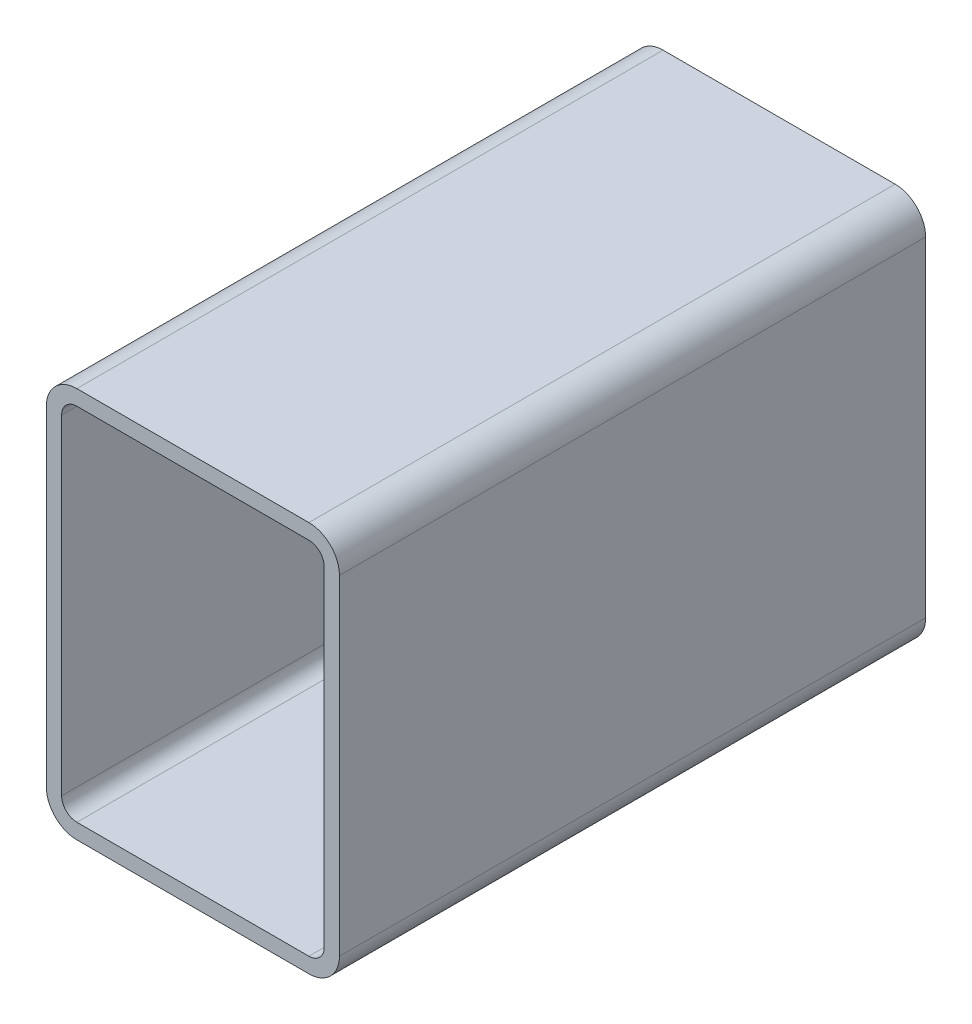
ISO-10303-21;
HEADER;
FILE_DESCRIPTION(('STEP AP214'),'2;1');
FILE_NAME('part.step','',(''),(''),'','','');
FILE_SCHEMA(('AUTOMOTIVE_DESIGN { 1 0 10303 214 1 1 1 1 }'));
ENDSEC;
DATA;
#1=APPLICATION_CONTEXT('core data for automotive mechanical design processes');
#2=APPLICATION_PROTOCOL_DEFINITION('international standard','automotive_design',2000,#1);
#3=PRODUCT_CONTEXT('',#1,'mechanical');
#4=PRODUCT('Part','Part','',(#3));
#5=PRODUCT_RELATED_PRODUCT_CATEGORY('part','',(#4));
#6=PRODUCT_DEFINITION_FORMATION('','',#4);
#7=PRODUCT_DEFINITION_CONTEXT('part definition',#1,'design');
#8=PRODUCT_DEFINITION('design','',#6,#7);
#9=PRODUCT_DEFINITION_SHAPE('','',#8);
#10=(LENGTH_UNIT() NAMED_UNIT(*) SI_UNIT(.MILLI.,.METRE.));
#11=(NAMED_UNIT(*) PLANE_ANGLE_UNIT() SI_UNIT($,.RADIAN.));
#12=(NAMED_UNIT(*) SI_UNIT($,.STERADIAN.) SOLID_ANGLE_UNIT());
#13=UNCERTAINTY_MEASURE_WITH_UNIT(LENGTH_MEASURE(1.E-05),#10,'distance_accuracy_value','');
#14=(GEOMETRIC_REPRESENTATION_CONTEXT(3) GLOBAL_UNCERTAINTY_ASSIGNED_CONTEXT((#13)) GLOBAL_UNIT_ASSIGNED_CONTEXT((#10,
#11,#12)) REPRESENTATION_CONTEXT('',''));
#15=CARTESIAN_POINT('',(0.,0.,0.));
#16=DIRECTION('',(0.,0.,1.));
#17=DIRECTION('',(1.,0.,0.));
#18=AXIS2_PLACEMENT_3D('',#15,#16,#17);
#19=CARTESIAN_POINT('',(15.9223013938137,189.291130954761,304.8));
#20=DIRECTION('',(0.,0.,1.));
#21=DIRECTION('',(1.,0.,0.));
#22=AXIS2_PLACEMENT_3D('',#19,#20,#21);
#23=PLANE('',#22);
#24=CARTESIAN_POINT('',(15.9223013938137,189.291130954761,304.8));
#25=DIRECTION('',(0.,0.,1.));
#26=DIRECTION('',(1.,0.,0.));
#27=AXIS2_PLACEMENT_3D('',#24,#25,#26);
#28=CIRCLE('',#27,15.875);
#29=CARTESIAN_POINT('',(15.9223013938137,205.166130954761,304.8));
#30=VERTEX_POINT('',#29);
#31=CARTESIAN_POINT('',(0.0473013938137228,189.291130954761,304.8));
#32=VERTEX_POINT('',#31);
#33=EDGE_CURVE('E211',#30,#32,#28,.T.);
#34=ORIENTED_EDGE('',*,*,#33,.T.);
#35=DIRECTION('',(0.,-1.,0.));
#36=VECTOR('',#35,1.);
#37=CARTESIAN_POINT('',(0.0473013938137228,17.8411309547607,304.8));
#38=LINE('',#37,#36);
#39=CARTESIAN_POINT('',(0.0473013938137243,17.8411309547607,304.8));
#40=VERTEX_POINT('',#39);
#41=EDGE_CURVE('E214',#32,#40,#38,.T.);
#42=ORIENTED_EDGE('',*,*,#41,.T.);
#43=CARTESIAN_POINT('',(15.9223013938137,17.8411309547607,304.8));
#44=DIRECTION('',(0.,0.,1.));
#45=DIRECTION('',(1.,0.,0.));
#46=AXIS2_PLACEMENT_3D('',#43,#44,#45);
#47=CIRCLE('',#46,15.875);
#48=CARTESIAN_POINT('',(15.9223013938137,1.96613095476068,304.8));
#49=VERTEX_POINT('',#48);
#50=EDGE_CURVE('E217',#40,#49,#47,.T.);
#51=ORIENTED_EDGE('',*,*,#50,.T.);
#52=DIRECTION('',(1.,0.,0.));
#53=VECTOR('',#52,1.);
#54=CARTESIAN_POINT('',(136.572301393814,1.96613095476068,304.8));
#55=LINE('',#54,#53);
#56=CARTESIAN_POINT('',(136.572301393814,1.96613095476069,304.8));
#57=VERTEX_POINT('',#56);
#58=EDGE_CURVE('E219',#49,#57,#55,.T.);
#59=ORIENTED_EDGE('',*,*,#58,.T.);
#60=CARTESIAN_POINT('',(136.572301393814,17.8411309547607,304.8));
#61=DIRECTION('',(0.,0.,1.));
#62=DIRECTION('',(1.,0.,0.));
#63=AXIS2_PLACEMENT_3D('',#60,#61,#62);
#64=CIRCLE('',#63,15.875);
#65=CARTESIAN_POINT('',(152.447301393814,17.8411309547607,304.8));
#66=VERTEX_POINT('',#65);
#67=EDGE_CURVE('E221',#57,#66,#64,.T.);
#68=ORIENTED_EDGE('',*,*,#67,.T.);
#69=DIRECTION('',(0.,1.,0.));
#70=VECTOR('',#69,1.);
#71=CARTESIAN_POINT('',(152.447301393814,189.291130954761,304.8));
#72=LINE('',#71,#70);
#73=CARTESIAN_POINT('',(152.447301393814,189.291130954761,304.8));
#74=VERTEX_POINT('',#73);
#75=EDGE_CURVE('E223',#66,#74,#72,.T.);
#76=ORIENTED_EDGE('',*,*,#75,.T.);
#77=CARTESIAN_POINT('',(136.572301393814,189.291130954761,304.8));
#78=DIRECTION('',(0.,0.,1.));
#79=DIRECTION('',(1.,0.,0.));
#80=AXIS2_PLACEMENT_3D('',#77,#78,#79);
#81=CIRCLE('',#80,15.875);
#82=CARTESIAN_POINT('',(136.572301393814,205.166130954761,304.8));
#83=VERTEX_POINT('',#82);
#84=EDGE_CURVE('E225',#74,#83,#81,.T.);
#85=ORIENTED_EDGE('',*,*,#84,.T.);
#86=DIRECTION('',(-1.,0.,0.));
#87=VECTOR('',#86,1.);
#88=CARTESIAN_POINT('',(15.9223013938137,205.166130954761,304.8));
#89=LINE('',#88,#87);
#90=EDGE_CURVE('E227',#83,#30,#89,.T.);
#91=ORIENTED_EDGE('',*,*,#90,.T.);
#92=EDGE_LOOP('',(#34,#42,#51,#59,#68,#76,#85,#91));
#93=FACE_BOUND('',#92,.T.);
#94=DIRECTION('',(0.,-1.,0.));
#95=VECTOR('',#94,1.);
#96=CARTESIAN_POINT('',(7.98480139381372,17.8411309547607,304.8));
#97=LINE('',#96,#95);
#98=CARTESIAN_POINT('',(7.98480139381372,189.291130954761,304.8));
#99=VERTEX_POINT('',#98);
#100=CARTESIAN_POINT('',(7.98480139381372,17.8411309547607,304.8));
#101=VERTEX_POINT('',#100);
#102=EDGE_CURVE('E154',#99,#101,#97,.T.);
#103=ORIENTED_EDGE('',*,*,#102,.F.);
#104=CARTESIAN_POINT('',(15.9223013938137,189.291130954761,304.8));
#105=DIRECTION('',(0.,0.,1.));
#106=DIRECTION('',(1.,0.,0.));
#107=AXIS2_PLACEMENT_3D('',#104,#105,#106);
#108=CIRCLE('',#107,7.9375);
#109=CARTESIAN_POINT('',(15.9223013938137,197.228630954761,304.8));
#110=VERTEX_POINT('',#109);
#111=EDGE_CURVE('E146',#110,#99,#108,.T.);
#112=ORIENTED_EDGE('',*,*,#111,.F.);
#113=DIRECTION('',(-1.,0.,0.));
#114=VECTOR('',#113,1.);
#115=CARTESIAN_POINT('',(15.9223013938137,197.228630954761,304.8));
#116=LINE('',#115,#114);
#117=CARTESIAN_POINT('',(136.572301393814,197.228630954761,304.8));
#118=VERTEX_POINT('',#117);
#119=EDGE_CURVE('E179',#118,#110,#116,.T.);
#120=ORIENTED_EDGE('',*,*,#119,.F.);
#121=CARTESIAN_POINT('',(136.572301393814,189.291130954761,304.8));
#122=DIRECTION('',(0.,0.,1.));
#123=DIRECTION('',(1.,0.,0.));
#124=AXIS2_PLACEMENT_3D('',#121,#122,#123);
#125=CIRCLE('',#124,7.9375);
#126=CARTESIAN_POINT('',(144.509801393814,189.291130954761,304.8));
#127=VERTEX_POINT('',#126);
#128=EDGE_CURVE('E177',#127,#118,#125,.T.);
#129=ORIENTED_EDGE('',*,*,#128,.F.);
#130=DIRECTION('',(0.,1.,0.));
#131=VECTOR('',#130,1.);
#132=CARTESIAN_POINT('',(144.509801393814,189.291130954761,304.8));
#133=LINE('',#132,#131);
#134=CARTESIAN_POINT('',(144.509801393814,17.8411309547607,304.8));
#135=VERTEX_POINT('',#134);
#136=EDGE_CURVE('E175',#135,#127,#133,.T.);
#137=ORIENTED_EDGE('',*,*,#136,.F.);
#138=CARTESIAN_POINT('',(136.572301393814,17.8411309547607,304.8));
#139=DIRECTION('',(0.,0.,1.));
#140=DIRECTION('',(1.,0.,0.));
#141=AXIS2_PLACEMENT_3D('',#138,#139,#140);
#142=CIRCLE('',#141,7.93750000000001);
#143=CARTESIAN_POINT('',(136.572301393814,9.90363095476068,304.8));
#144=VERTEX_POINT('',#143);
#145=EDGE_CURVE('E173',#144,#135,#142,.T.);
#146=ORIENTED_EDGE('',*,*,#145,.F.);
#147=DIRECTION('',(1.,0.,0.));
#148=VECTOR('',#147,1.);
#149=CARTESIAN_POINT('',(136.572301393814,9.90363095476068,304.8));
#150=LINE('',#149,#148);
#151=CARTESIAN_POINT('',(15.9223013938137,9.90363095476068,304.8));
#152=VERTEX_POINT('',#151);
#153=EDGE_CURVE('E169',#152,#144,#150,.T.);
#154=ORIENTED_EDGE('',*,*,#153,.F.);
#155=CARTESIAN_POINT('',(15.9223013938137,17.8411309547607,304.8));
#156=DIRECTION('',(0.,0.,1.));
#157=DIRECTION('',(1.,0.,0.));
#158=AXIS2_PLACEMENT_3D('',#155,#156,#157);
#159=CIRCLE('',#158,7.9375);
#160=EDGE_CURVE('E167',#101,#152,#159,.T.);
#161=ORIENTED_EDGE('',*,*,#160,.F.);
#162=EDGE_LOOP('',(#103,#112,#120,#129,#137,#146,#154,#161));
#163=FACE_BOUND('',#162,.T.);
#164=ADVANCED_FACE('F33',(#93,#163),#23,.T.);
#165=CARTESIAN_POINT('',(15.9223013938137,189.291130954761,0.));
#166=DIRECTION('',(0.,0.,1.));
#167=DIRECTION('',(1.,0.,0.));
#168=AXIS2_PLACEMENT_3D('',#165,#166,#167);
#169=PLANE('',#168);
#170=CARTESIAN_POINT('',(15.9223013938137,189.291130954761,0.));
#171=DIRECTION('',(0.,0.,1.));
#172=DIRECTION('',(1.,0.,0.));
#173=AXIS2_PLACEMENT_3D('',#170,#171,#172);
#174=CIRCLE('',#173,15.875);
#175=CARTESIAN_POINT('',(15.9223013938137,205.166130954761,0.));
#176=VERTEX_POINT('',#175);
#177=CARTESIAN_POINT('',(0.0473013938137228,189.291130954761,0.));
#178=VERTEX_POINT('',#177);
#179=EDGE_CURVE('E162',#176,#178,#174,.T.);
#180=ORIENTED_EDGE('',*,*,#179,.F.);
#181=DIRECTION('',(-1.,0.,0.));
#182=VECTOR('',#181,1.);
#183=CARTESIAN_POINT('',(15.9223013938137,205.166130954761,0.));
#184=LINE('',#183,#182);
#185=CARTESIAN_POINT('',(136.572301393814,205.166130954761,0.));
#186=VERTEX_POINT('',#185);
#187=EDGE_CURVE('E215',#186,#176,#184,.T.);
#188=ORIENTED_EDGE('',*,*,#187,.F.);
#189=CARTESIAN_POINT('',(136.572301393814,189.291130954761,0.));
#190=DIRECTION('',(0.,0.,1.));
#191=DIRECTION('',(1.,0.,0.));
#192=AXIS2_PLACEMENT_3D('',#189,#190,#191);
#193=CIRCLE('',#192,15.875);
#194=CARTESIAN_POINT('',(152.447301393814,189.291130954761,0.));
#195=VERTEX_POINT('',#194);
#196=EDGE_CURVE('E242',#195,#186,#193,.T.);
#197=ORIENTED_EDGE('',*,*,#196,.F.);
#198=DIRECTION('',(0.,1.,0.));
#199=VECTOR('',#198,1.);
#200=CARTESIAN_POINT('',(152.447301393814,189.291130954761,0.));
#201=LINE('',#200,#199);
#202=CARTESIAN_POINT('',(152.447301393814,17.8411309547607,0.));
#203=VERTEX_POINT('',#202);
#204=EDGE_CURVE('E240',#203,#195,#201,.T.);
#205=ORIENTED_EDGE('',*,*,#204,.F.);
#206=CARTESIAN_POINT('',(136.572301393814,17.8411309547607,0.));
#207=DIRECTION('',(0.,0.,1.));
#208=DIRECTION('',(1.,0.,0.));
#209=AXIS2_PLACEMENT_3D('',#206,#207,#208);
#210=CIRCLE('',#209,15.875);
#211=CARTESIAN_POINT('',(136.572301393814,1.96613095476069,0.));
#212=VERTEX_POINT('',#211);
#213=EDGE_CURVE('E238',#212,#203,#210,.T.);
#214=ORIENTED_EDGE('',*,*,#213,.F.);
#215=DIRECTION('',(1.,0.,0.));
#216=VECTOR('',#215,1.);
#217=CARTESIAN_POINT('',(136.572301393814,1.96613095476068,0.));
#218=LINE('',#217,#216);
#219=CARTESIAN_POINT('',(15.9223013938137,1.96613095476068,0.));
#220=VERTEX_POINT('',#219);
#221=EDGE_CURVE('E236',#220,#212,#218,.T.);
#222=ORIENTED_EDGE('',*,*,#221,.F.);
#223=CARTESIAN_POINT('',(15.9223013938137,17.8411309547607,0.));
#224=DIRECTION('',(0.,0.,1.));
#225=DIRECTION('',(1.,0.,0.));
#226=AXIS2_PLACEMENT_3D('',#223,#224,#225);
#227=CIRCLE('',#226,15.875);
#228=CARTESIAN_POINT('',(0.0473013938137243,17.8411309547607,0.));
#229=VERTEX_POINT('',#228);
#230=EDGE_CURVE('E234',#229,#220,#227,.T.);
#231=ORIENTED_EDGE('',*,*,#230,.F.);
#232=DIRECTION('',(0.,-1.,0.));
#233=VECTOR('',#232,1.);
#234=CARTESIAN_POINT('',(0.0473013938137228,17.8411309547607,0.));
#235=LINE('',#234,#233);
#236=EDGE_CURVE('E232',#178,#229,#235,.T.);
#237=ORIENTED_EDGE('',*,*,#236,.F.);
#238=EDGE_LOOP('',(#180,#188,#197,#205,#214,#222,#231,#237));
#239=FACE_BOUND('',#238,.T.);
#240=CARTESIAN_POINT('',(15.9223013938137,189.291130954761,0.));
#241=DIRECTION('',(0.,0.,1.));
#242=DIRECTION('',(1.,0.,0.));
#243=AXIS2_PLACEMENT_3D('',#240,#241,#242);
#244=CIRCLE('',#243,7.9375);
#245=CARTESIAN_POINT('',(15.9223013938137,197.228630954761,0.));
#246=VERTEX_POINT('',#245);
#247=CARTESIAN_POINT('',(7.98480139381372,189.291130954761,0.));
#248=VERTEX_POINT('',#247);
#249=EDGE_CURVE('E56',#246,#248,#244,.T.);
#250=ORIENTED_EDGE('',*,*,#249,.T.);
#251=DIRECTION('',(0.,-1.,0.));
#252=VECTOR('',#251,1.);
#253=CARTESIAN_POINT('',(7.98480139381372,17.8411309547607,0.));
#254=LINE('',#253,#252);
#255=CARTESIAN_POINT('',(7.98480139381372,17.8411309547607,0.));
#256=VERTEX_POINT('',#255);
#257=EDGE_CURVE('E161',#248,#256,#254,.T.);
#258=ORIENTED_EDGE('',*,*,#257,.T.);
#259=CARTESIAN_POINT('',(15.9223013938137,17.8411309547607,0.));
#260=DIRECTION('',(0.,0.,1.));
#261=DIRECTION('',(1.,0.,0.));
#262=AXIS2_PLACEMENT_3D('',#259,#260,#261);
#263=CIRCLE('',#262,7.9375);
#264=CARTESIAN_POINT('',(15.9223013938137,9.90363095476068,0.));
#265=VERTEX_POINT('',#264);
#266=EDGE_CURVE('E183',#256,#265,#263,.T.);
#267=ORIENTED_EDGE('',*,*,#266,.T.);
#268=DIRECTION('',(1.,0.,0.));
#269=VECTOR('',#268,1.);
#270=CARTESIAN_POINT('',(136.572301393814,9.90363095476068,0.));
#271=LINE('',#270,#269);
#272=CARTESIAN_POINT('',(136.572301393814,9.90363095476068,0.));
#273=VERTEX_POINT('',#272);
#274=EDGE_CURVE('E186',#265,#273,#271,.T.);
#275=ORIENTED_EDGE('',*,*,#274,.T.);
#276=CARTESIAN_POINT('',(136.572301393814,17.8411309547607,0.));
#277=DIRECTION('',(0.,0.,1.));
#278=DIRECTION('',(1.,0.,0.));
#279=AXIS2_PLACEMENT_3D('',#276,#277,#278);
#280=CIRCLE('',#279,7.93750000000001);
#281=CARTESIAN_POINT('',(144.509801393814,17.8411309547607,0.));
#282=VERTEX_POINT('',#281);
#283=EDGE_CURVE('E189',#273,#282,#280,.T.);
#284=ORIENTED_EDGE('',*,*,#283,.T.);
#285=DIRECTION('',(0.,1.,0.));
#286=VECTOR('',#285,1.);
#287=CARTESIAN_POINT('',(144.509801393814,189.291130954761,0.));
#288=LINE('',#287,#286);
#289=CARTESIAN_POINT('',(144.509801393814,189.291130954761,0.));
#290=VERTEX_POINT('',#289);
#291=EDGE_CURVE('E192',#282,#290,#288,.T.);
#292=ORIENTED_EDGE('',*,*,#291,.T.);
#293=CARTESIAN_POINT('',(136.572301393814,189.291130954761,0.));
#294=DIRECTION('',(0.,0.,1.));
#295=DIRECTION('',(1.,0.,0.));
#296=AXIS2_PLACEMENT_3D('',#293,#294,#295);
#297=CIRCLE('',#296,7.9375);
#298=CARTESIAN_POINT('',(136.572301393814,197.228630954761,0.));
#299=VERTEX_POINT('',#298);
#300=EDGE_CURVE('E195',#290,#299,#297,.T.);
#301=ORIENTED_EDGE('',*,*,#300,.T.);
#302=DIRECTION('',(-1.,0.,0.));
#303=VECTOR('',#302,1.);
#304=CARTESIAN_POINT('',(15.9223013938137,197.228630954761,0.));
#305=LINE('',#304,#303);
#306=EDGE_CURVE('E155',#299,#246,#305,.T.);
#307=ORIENTED_EDGE('',*,*,#306,.T.);
#308=EDGE_LOOP('',(#250,#258,#267,#275,#284,#292,#301,#307));
#309=FACE_BOUND('',#308,.T.);
#310=ADVANCED_FACE('F272',(#239,#309),#169,.F.);
#311=CARTESIAN_POINT('',(15.9223013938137,189.291130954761,304.8));
#312=DIRECTION('',(0.,0.,-1.));
#313=DIRECTION('',(-1.,0.,0.));
#314=AXIS2_PLACEMENT_3D('',#311,#312,#313);
#315=CYLINDRICAL_SURFACE('',#314,15.875);
#316=ORIENTED_EDGE('',*,*,#179,.T.);
#317=DIRECTION('',(0.,0.,-1.));
#318=VECTOR('',#317,1.);
#319=CARTESIAN_POINT('',(0.0473013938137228,189.291130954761,304.8));
#320=LINE('',#319,#318);
#321=EDGE_CURVE('E11',#32,#178,#320,.T.);
#322=ORIENTED_EDGE('',*,*,#321,.F.);
#323=ORIENTED_EDGE('',*,*,#33,.F.);
#324=DIRECTION('',(0.,0.,-1.));
#325=VECTOR('',#324,1.);
#326=CARTESIAN_POINT('',(15.9223013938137,205.166130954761,304.8));
#327=LINE('',#326,#325);
#328=EDGE_CURVE('E229',#30,#176,#327,.T.);
#329=ORIENTED_EDGE('',*,*,#328,.T.);
#330=EDGE_LOOP('',(#316,#322,#323,#329));
#331=FACE_BOUND('',#330,.T.);
#332=ADVANCED_FACE('F35',(#331),#315,.T.);
#333=CARTESIAN_POINT('',(0.0473013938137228,17.8411309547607,304.8));
#334=DIRECTION('',(1.,0.,0.));
#335=DIRECTION('',(0.,0.,-1.));
#336=AXIS2_PLACEMENT_3D('',#333,#334,#335);
#337=PLANE('',#336);
#338=ORIENTED_EDGE('',*,*,#236,.T.);
#339=DIRECTION('',(0.,0.,-1.));
#340=VECTOR('',#339,1.);
#341=CARTESIAN_POINT('',(0.0473013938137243,17.8411309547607,304.8));
#342=LINE('',#341,#340);
#343=EDGE_CURVE('E41',#40,#229,#342,.T.);
#344=ORIENTED_EDGE('',*,*,#343,.F.);
#345=ORIENTED_EDGE('',*,*,#41,.F.);
#346=ORIENTED_EDGE('',*,*,#321,.T.);
#347=EDGE_LOOP('',(#338,#344,#345,#346));
#348=FACE_BOUND('',#347,.T.);
#349=ADVANCED_FACE('F289',(#348),#337,.F.);
#350=CARTESIAN_POINT('',(15.9223013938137,17.8411309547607,304.8));
#351=DIRECTION('',(0.,0.,-1.));
#352=DIRECTION('',(-1.,0.,0.));
#353=AXIS2_PLACEMENT_3D('',#350,#351,#352);
#354=CYLINDRICAL_SURFACE('',#353,15.875);
#355=ORIENTED_EDGE('',*,*,#230,.T.);
#356=DIRECTION('',(0.,0.,-1.));
#357=VECTOR('',#356,1.);
#358=CARTESIAN_POINT('',(15.9223013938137,1.96613095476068,304.8));
#359=LINE('',#358,#357);
#360=EDGE_CURVE('E259',#49,#220,#359,.T.);
#361=ORIENTED_EDGE('',*,*,#360,.F.);
#362=ORIENTED_EDGE('',*,*,#50,.F.);
#363=ORIENTED_EDGE('',*,*,#343,.T.);
#364=EDGE_LOOP('',(#355,#361,#362,#363));
#365=FACE_BOUND('',#364,.T.);
#366=ADVANCED_FACE('F266',(#365),#354,.T.);
#367=CARTESIAN_POINT('',(136.572301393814,1.96613095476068,304.8));
#368=DIRECTION('',(0.,1.,0.));
#369=DIRECTION('',(0.,0.,1.));
#370=AXIS2_PLACEMENT_3D('',#367,#368,#369);
#371=PLANE('',#370);
#372=ORIENTED_EDGE('',*,*,#221,.T.);
#373=DIRECTION('',(0.,0.,-1.));
#374=VECTOR('',#373,1.);
#375=CARTESIAN_POINT('',(136.572301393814,1.96613095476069,304.8));
#376=LINE('',#375,#374);
#377=EDGE_CURVE('E256',#57,#212,#376,.T.);
#378=ORIENTED_EDGE('',*,*,#377,.F.);
#379=ORIENTED_EDGE('',*,*,#58,.F.);
#380=ORIENTED_EDGE('',*,*,#360,.T.);
#381=EDGE_LOOP('',(#372,#378,#379,#380));
#382=FACE_BOUND('',#381,.T.);
#383=ADVANCED_FACE('F278',(#382),#371,.F.);
#384=CARTESIAN_POINT('',(136.572301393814,17.8411309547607,304.8));
#385=DIRECTION('',(0.,0.,-1.));
#386=DIRECTION('',(-1.,0.,0.));
#387=AXIS2_PLACEMENT_3D('',#384,#385,#386);
#388=CYLINDRICAL_SURFACE('',#387,15.875);
#389=ORIENTED_EDGE('',*,*,#213,.T.);
#390=DIRECTION('',(0.,0.,-1.));
#391=VECTOR('',#390,1.);
#392=CARTESIAN_POINT('',(152.447301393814,17.8411309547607,304.8));
#393=LINE('',#392,#391);
#394=EDGE_CURVE('E253',#66,#203,#393,.T.);
#395=ORIENTED_EDGE('',*,*,#394,.F.);
#396=ORIENTED_EDGE('',*,*,#67,.F.);
#397=ORIENTED_EDGE('',*,*,#377,.T.);
#398=EDGE_LOOP('',(#389,#395,#396,#397));
#399=FACE_BOUND('',#398,.T.);
#400=ADVANCED_FACE('F282',(#399),#388,.T.);
#401=CARTESIAN_POINT('',(152.447301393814,189.291130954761,304.8));
#402=DIRECTION('',(-1.,0.,0.));
#403=DIRECTION('',(0.,0.,1.));
#404=AXIS2_PLACEMENT_3D('',#401,#402,#403);
#405=PLANE('',#404);
#406=ORIENTED_EDGE('',*,*,#204,.T.);
#407=DIRECTION('',(0.,0.,-1.));
#408=VECTOR('',#407,1.);
#409=CARTESIAN_POINT('',(152.447301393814,189.291130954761,304.8));
#410=LINE('',#409,#408);
#411=EDGE_CURVE('E250',#74,#195,#410,.T.);
#412=ORIENTED_EDGE('',*,*,#411,.F.);
#413=ORIENTED_EDGE('',*,*,#75,.F.);
#414=ORIENTED_EDGE('',*,*,#394,.T.);
#415=EDGE_LOOP('',(#406,#412,#413,#414));
#416=FACE_BOUND('',#415,.T.);
#417=ADVANCED_FACE('F302',(#416),#405,.F.);
#418=CARTESIAN_POINT('',(136.572301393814,189.291130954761,304.8));
#419=DIRECTION('',(0.,0.,-1.));
#420=DIRECTION('',(-1.,0.,0.));
#421=AXIS2_PLACEMENT_3D('',#418,#419,#420);
#422=CYLINDRICAL_SURFACE('',#421,15.875);
#423=ORIENTED_EDGE('',*,*,#196,.T.);
#424=DIRECTION('',(0.,0.,-1.));
#425=VECTOR('',#424,1.);
#426=CARTESIAN_POINT('',(136.572301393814,205.166130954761,304.8));
#427=LINE('',#426,#425);
#428=EDGE_CURVE('E247',#83,#186,#427,.T.);
#429=ORIENTED_EDGE('',*,*,#428,.F.);
#430=ORIENTED_EDGE('',*,*,#84,.F.);
#431=ORIENTED_EDGE('',*,*,#411,.T.);
#432=EDGE_LOOP('',(#423,#429,#430,#431));
#433=FACE_BOUND('',#432,.T.);
#434=ADVANCED_FACE('F300',(#433),#422,.T.);
#435=CARTESIAN_POINT('',(15.9223013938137,205.166130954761,304.8));
#436=DIRECTION('',(0.,-1.,0.));
#437=DIRECTION('',(0.,0.,-1.));
#438=AXIS2_PLACEMENT_3D('',#435,#436,#437);
#439=PLANE('',#438);
#440=ORIENTED_EDGE('',*,*,#187,.T.);
#441=ORIENTED_EDGE('',*,*,#328,.F.);
#442=ORIENTED_EDGE('',*,*,#90,.F.);
#443=ORIENTED_EDGE('',*,*,#428,.T.);
#444=EDGE_LOOP('',(#440,#441,#442,#443));
#445=FACE_BOUND('',#444,.T.);
#446=ADVANCED_FACE('F295',(#445),#439,.F.);
#447=CARTESIAN_POINT('',(15.9223013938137,189.291130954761,304.8));
#448=DIRECTION('',(0.,0.,-1.));
#449=DIRECTION('',(-1.,0.,0.));
#450=AXIS2_PLACEMENT_3D('',#447,#448,#449);
#451=CYLINDRICAL_SURFACE('',#450,7.9375);
#452=ORIENTED_EDGE('',*,*,#249,.F.);
#453=DIRECTION('',(0.,0.,-1.));
#454=VECTOR('',#453,1.);
#455=CARTESIAN_POINT('',(15.9223013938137,197.228630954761,304.8));
#456=LINE('',#455,#454);
#457=EDGE_CURVE('E150',#110,#246,#456,.T.);
#458=ORIENTED_EDGE('',*,*,#457,.F.);
#459=ORIENTED_EDGE('',*,*,#111,.T.);
#460=DIRECTION('',(0.,0.,-1.));
#461=VECTOR('',#460,1.);
#462=CARTESIAN_POINT('',(7.98480139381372,189.291130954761,304.8));
#463=LINE('',#462,#461);
#464=EDGE_CURVE('E149',#99,#248,#463,.T.);
#465=ORIENTED_EDGE('',*,*,#464,.T.);
#466=EDGE_LOOP('',(#452,#458,#459,#465));
#467=FACE_BOUND('',#466,.T.);
#468=ADVANCED_FACE('F148',(#467),#451,.F.);
#469=CARTESIAN_POINT('',(7.98480139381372,17.8411309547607,304.8));
#470=DIRECTION('',(1.,0.,0.));
#471=DIRECTION('',(0.,0.,-1.));
#472=AXIS2_PLACEMENT_3D('',#469,#470,#471);
#473=PLANE('',#472);
#474=ORIENTED_EDGE('',*,*,#257,.F.);
#475=ORIENTED_EDGE('',*,*,#464,.F.);
#476=ORIENTED_EDGE('',*,*,#102,.T.);
#477=DIRECTION('',(0.,0.,-1.));
#478=VECTOR('',#477,1.);
#479=CARTESIAN_POINT('',(7.98480139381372,17.8411309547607,304.8));
#480=LINE('',#479,#478);
#481=EDGE_CURVE('E163',#101,#256,#480,.T.);
#482=ORIENTED_EDGE('',*,*,#481,.T.);
#483=EDGE_LOOP('',(#474,#475,#476,#482));
#484=FACE_BOUND('',#483,.T.);
#485=ADVANCED_FACE('F158',(#484),#473,.T.);
#486=CARTESIAN_POINT('',(15.9223013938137,17.8411309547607,304.8));
#487=DIRECTION('',(0.,0.,-1.));
#488=DIRECTION('',(-1.,0.,0.));
#489=AXIS2_PLACEMENT_3D('',#486,#487,#488);
#490=CYLINDRICAL_SURFACE('',#489,7.9375);
#491=ORIENTED_EDGE('',*,*,#266,.F.);
#492=ORIENTED_EDGE('',*,*,#481,.F.);
#493=ORIENTED_EDGE('',*,*,#160,.T.);
#494=DIRECTION('',(0.,0.,-1.));
#495=VECTOR('',#494,1.);
#496=CARTESIAN_POINT('',(15.9223013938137,9.90363095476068,304.8));
#497=LINE('',#496,#495);
#498=EDGE_CURVE('E208',#152,#265,#497,.T.);
#499=ORIENTED_EDGE('',*,*,#498,.T.);
#500=EDGE_LOOP('',(#491,#492,#493,#499));
#501=FACE_BOUND('',#500,.T.);
#502=ADVANCED_FACE('F327',(#501),#490,.F.);
#503=CARTESIAN_POINT('',(136.572301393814,9.90363095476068,304.8));
#504=DIRECTION('',(0.,1.,0.));
#505=DIRECTION('',(0.,0.,1.));
#506=AXIS2_PLACEMENT_3D('',#503,#504,#505);
#507=PLANE('',#506);
#508=ORIENTED_EDGE('',*,*,#274,.F.);
#509=ORIENTED_EDGE('',*,*,#498,.F.);
#510=ORIENTED_EDGE('',*,*,#153,.T.);
#511=DIRECTION('',(0.,0.,-1.));
#512=VECTOR('',#511,1.);
#513=CARTESIAN_POINT('',(136.572301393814,9.90363095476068,304.8));
#514=LINE('',#513,#512);
#515=EDGE_CURVE('E206',#144,#273,#514,.T.);
#516=ORIENTED_EDGE('',*,*,#515,.T.);
#517=EDGE_LOOP('',(#508,#509,#510,#516));
#518=FACE_BOUND('',#517,.T.);
#519=ADVANCED_FACE('F331',(#518),#507,.T.);
#520=CARTESIAN_POINT('',(136.572301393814,17.8411309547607,304.8));
#521=DIRECTION('',(0.,0.,-1.));
#522=DIRECTION('',(-1.,0.,0.));
#523=AXIS2_PLACEMENT_3D('',#520,#521,#522);
#524=CYLINDRICAL_SURFACE('',#523,7.93750000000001);
#525=ORIENTED_EDGE('',*,*,#283,.F.);
#526=ORIENTED_EDGE('',*,*,#515,.F.);
#527=ORIENTED_EDGE('',*,*,#145,.T.);
#528=DIRECTION('',(0.,0.,-1.));
#529=VECTOR('',#528,1.);
#530=CARTESIAN_POINT('',(144.509801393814,17.8411309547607,304.8));
#531=LINE('',#530,#529);
#532=EDGE_CURVE('E204',#135,#282,#531,.T.);
#533=ORIENTED_EDGE('',*,*,#532,.T.);
#534=EDGE_LOOP('',(#525,#526,#527,#533));
#535=FACE_BOUND('',#534,.T.);
#536=ADVANCED_FACE('F337',(#535),#524,.F.);
#537=CARTESIAN_POINT('',(144.509801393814,189.291130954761,304.8));
#538=DIRECTION('',(-1.,0.,0.));
#539=DIRECTION('',(0.,0.,1.));
#540=AXIS2_PLACEMENT_3D('',#537,#538,#539);
#541=PLANE('',#540);
#542=ORIENTED_EDGE('',*,*,#291,.F.);
#543=ORIENTED_EDGE('',*,*,#532,.F.);
#544=ORIENTED_EDGE('',*,*,#136,.T.);
#545=DIRECTION('',(0.,0.,-1.));
#546=VECTOR('',#545,1.);
#547=CARTESIAN_POINT('',(144.509801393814,189.291130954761,304.8));
#548=LINE('',#547,#546);
#549=EDGE_CURVE('E202',#127,#290,#548,.T.);
#550=ORIENTED_EDGE('',*,*,#549,.T.);
#551=EDGE_LOOP('',(#542,#543,#544,#550));
#552=FACE_BOUND('',#551,.T.);
#553=ADVANCED_FACE('F341',(#552),#541,.T.);
#554=CARTESIAN_POINT('',(136.572301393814,189.291130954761,304.8));
#555=DIRECTION('',(0.,0.,-1.));
#556=DIRECTION('',(-1.,0.,0.));
#557=AXIS2_PLACEMENT_3D('',#554,#555,#556);
#558=CYLINDRICAL_SURFACE('',#557,7.9375);
#559=ORIENTED_EDGE('',*,*,#300,.F.);
#560=ORIENTED_EDGE('',*,*,#549,.F.);
#561=ORIENTED_EDGE('',*,*,#128,.T.);
#562=DIRECTION('',(0.,0.,-1.));
#563=VECTOR('',#562,1.);
#564=CARTESIAN_POINT('',(136.572301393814,197.228630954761,304.8));
#565=LINE('',#564,#563);
#566=EDGE_CURVE('E48',#118,#299,#565,.T.);
#567=ORIENTED_EDGE('',*,*,#566,.T.);
#568=EDGE_LOOP('',(#559,#560,#561,#567));
#569=FACE_BOUND('',#568,.T.);
#570=ADVANCED_FACE('F345',(#569),#558,.F.);
#571=CARTESIAN_POINT('',(15.9223013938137,197.228630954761,304.8));
#572=DIRECTION('',(0.,-1.,0.));
#573=DIRECTION('',(0.,0.,-1.));
#574=AXIS2_PLACEMENT_3D('',#571,#572,#573);
#575=PLANE('',#574);
#576=ORIENTED_EDGE('',*,*,#306,.F.);
#577=ORIENTED_EDGE('',*,*,#566,.F.);
#578=ORIENTED_EDGE('',*,*,#119,.T.);
#579=ORIENTED_EDGE('',*,*,#457,.T.);
#580=EDGE_LOOP('',(#576,#577,#578,#579));
#581=FACE_BOUND('',#580,.T.);
#582=ADVANCED_FACE('F349',(#581),#575,.T.);
#583=CLOSED_SHELL('',(#164,#310,#332,#349,#366,#383,#400,#417,#434,#446,#468,#485,#502,#519,
#536,#553,#570,#582));
#584=MANIFOLD_SOLID_BREP('B2',#583);
#585=ADVANCED_BREP_SHAPE_REPRESENTATION('',(#18,#584),#14);
#586=SHAPE_DEFINITION_REPRESENTATION(#9,#585);
ENDSEC;
END-ISO-10303-21;
